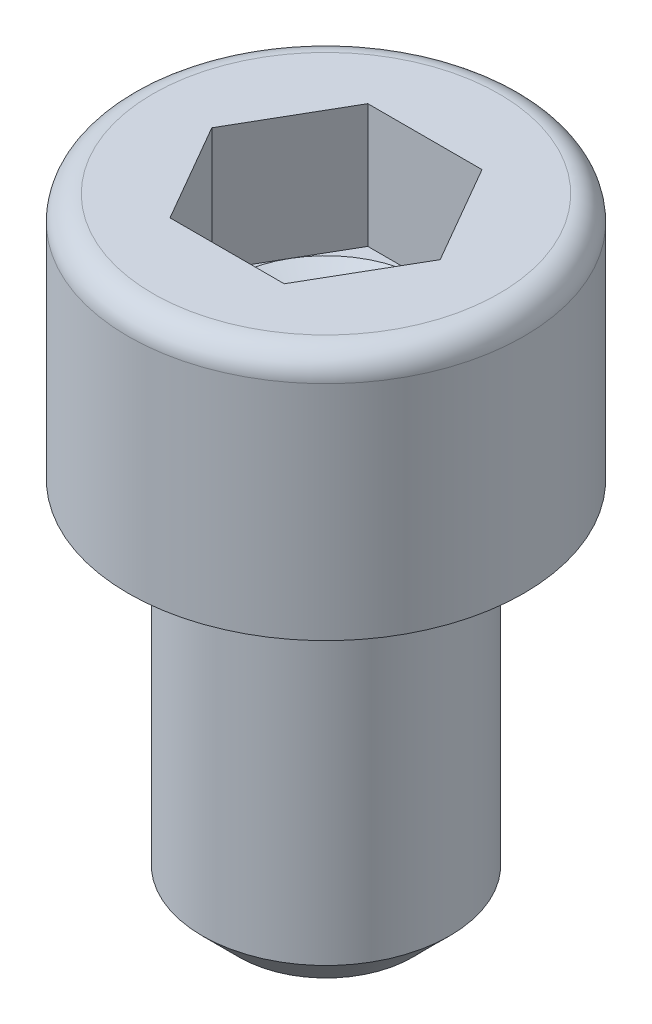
ISO-10303-21;
HEADER;
FILE_DESCRIPTION(('STEP AP214'),'2;1');
FILE_NAME('part.step','',(''),(''),'','','');
FILE_SCHEMA(('AUTOMOTIVE_DESIGN { 1 0 10303 214 1 1 1 1 }'));
ENDSEC;
DATA;
#1=APPLICATION_CONTEXT('core data for automotive mechanical design processes');
#2=APPLICATION_PROTOCOL_DEFINITION('international standard','automotive_design',2000,#1);
#3=PRODUCT_CONTEXT('',#1,'mechanical');
#4=PRODUCT('Part','Part','',(#3));
#5=PRODUCT_RELATED_PRODUCT_CATEGORY('part','',(#4));
#6=PRODUCT_DEFINITION_FORMATION('','',#4);
#7=PRODUCT_DEFINITION_CONTEXT('part definition',#1,'design');
#8=PRODUCT_DEFINITION('design','',#6,#7);
#9=PRODUCT_DEFINITION_SHAPE('','',#8);
#10=(LENGTH_UNIT() NAMED_UNIT(*) SI_UNIT(.MILLI.,.METRE.));
#11=(NAMED_UNIT(*) PLANE_ANGLE_UNIT() SI_UNIT($,.RADIAN.));
#12=(NAMED_UNIT(*) SI_UNIT($,.STERADIAN.) SOLID_ANGLE_UNIT());
#13=UNCERTAINTY_MEASURE_WITH_UNIT(LENGTH_MEASURE(1.E-05),#10,'distance_accuracy_value','');
#14=(GEOMETRIC_REPRESENTATION_CONTEXT(3) GLOBAL_UNCERTAINTY_ASSIGNED_CONTEXT((#13)) GLOBAL_UNIT_ASSIGNED_CONTEXT((#10,
#11,#12)) REPRESENTATION_CONTEXT('',''));
#15=CARTESIAN_POINT('',(0.,0.,0.));
#16=DIRECTION('',(0.,0.,1.));
#17=DIRECTION('',(1.,0.,0.));
#18=AXIS2_PLACEMENT_3D('',#15,#16,#17);
#19=CARTESIAN_POINT('',(4.,10.,0.));
#20=DIRECTION('',(0.,-1.,0.));
#21=DIRECTION('',(1.,0.,0.));
#22=AXIS2_PLACEMENT_3D('',#19,#20,#21);
#23=PLANE('',#22);
#24=CARTESIAN_POINT('',(0.,10.,0.));
#25=DIRECTION('',(0.,1.,0.));
#26=DIRECTION('',(-1.,0.,0.));
#27=AXIS2_PLACEMENT_3D('',#24,#25,#26);
#28=CIRCLE('',#27,7.);
#29=CARTESIAN_POINT('',(-7.,10.,0.));
#30=VERTEX_POINT('',#29);
#31=EDGE_CURVE('E138',#30,#30,#28,.T.);
#32=ORIENTED_EDGE('',*,*,#31,.T.);
#33=EDGE_LOOP('',(#32));
#34=FACE_BOUND('',#33,.T.);
#35=DIRECTION('',(0.499999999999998,0.,0.86602540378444));
#36=VECTOR('',#35,1.);
#37=CARTESIAN_POINT('',(2.30940107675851,10.,-4.));
#38=LINE('',#37,#36);
#39=CARTESIAN_POINT('',(2.30940107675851,10.,-4.));
#40=VERTEX_POINT('',#39);
#41=CARTESIAN_POINT('',(4.618802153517,10.,0.));
#42=VERTEX_POINT('',#41);
#43=EDGE_CURVE('E370',#40,#42,#38,.T.);
#44=ORIENTED_EDGE('',*,*,#43,.T.);
#45=DIRECTION('',(-0.499999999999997,0.,0.86602540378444));
#46=VECTOR('',#45,1.);
#47=CARTESIAN_POINT('',(2.30940107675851,10.,4.));
#48=LINE('',#47,#46);
#49=CARTESIAN_POINT('',(2.30940107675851,10.,4.));
#50=VERTEX_POINT('',#49);
#51=EDGE_CURVE('E373',#42,#50,#48,.T.);
#52=ORIENTED_EDGE('',*,*,#51,.T.);
#53=DIRECTION('',(-1.,0.,0.));
#54=VECTOR('',#53,1.);
#55=CARTESIAN_POINT('',(2.30940107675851,10.,4.));
#56=LINE('',#55,#54);
#57=CARTESIAN_POINT('',(-2.30940107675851,10.,4.));
#58=VERTEX_POINT('',#57);
#59=EDGE_CURVE('E376',#50,#58,#56,.T.);
#60=ORIENTED_EDGE('',*,*,#59,.T.);
#61=DIRECTION('',(-0.499999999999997,0.,-0.86602540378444));
#62=VECTOR('',#61,1.);
#63=CARTESIAN_POINT('',(-2.30940107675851,10.,4.));
#64=LINE('',#63,#62);
#65=CARTESIAN_POINT('',(-4.618802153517,10.,0.));
#66=VERTEX_POINT('',#65);
#67=EDGE_CURVE('E115',#58,#66,#64,.T.);
#68=ORIENTED_EDGE('',*,*,#67,.T.);
#69=DIRECTION('',(0.499999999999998,0.,-0.86602540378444));
#70=VECTOR('',#69,1.);
#71=CARTESIAN_POINT('',(-2.30940107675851,10.,-4.));
#72=LINE('',#71,#70);
#73=CARTESIAN_POINT('',(-2.30940107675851,10.,-4.));
#74=VERTEX_POINT('',#73);
#75=EDGE_CURVE('E367',#66,#74,#72,.T.);
#76=ORIENTED_EDGE('',*,*,#75,.T.);
#77=DIRECTION('',(1.,0.,0.));
#78=VECTOR('',#77,1.);
#79=CARTESIAN_POINT('',(2.30940107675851,10.,-4.));
#80=LINE('',#79,#78);
#81=EDGE_CURVE('E126',#74,#40,#80,.T.);
#82=ORIENTED_EDGE('',*,*,#81,.T.);
#83=EDGE_LOOP('',(#44,#52,#60,#68,#76,#82));
#84=FACE_BOUND('',#83,.T.);
#85=ADVANCED_FACE('F32',(#34,#84),#23,.F.);
#86=CARTESIAN_POINT('',(0.,-15.,0.));
#87=DIRECTION('',(0.,1.,0.));
#88=DIRECTION('',(0.,0.,1.));
#89=AXIS2_PLACEMENT_3D('',#86,#87,#88);
#90=CYLINDRICAL_SURFACE('',#89,5.);
#91=CARTESIAN_POINT('',(0.,-13.5,0.));
#92=DIRECTION('',(0.,1.,0.));
#93=DIRECTION('',(0.,0.,1.));
#94=AXIS2_PLACEMENT_3D('',#91,#92,#93);
#95=CIRCLE('',#94,5.);
#96=CARTESIAN_POINT('',(0.,-13.5,5.));
#97=VERTEX_POINT('',#96);
#98=EDGE_CURVE('E40',#97,#97,#95,.T.);
#99=ORIENTED_EDGE('',*,*,#98,.T.);
#100=EDGE_LOOP('',(#99));
#101=FACE_BOUND('',#100,.T.);
#102=CARTESIAN_POINT('',(0.,0.,0.));
#103=DIRECTION('',(0.,1.,0.));
#104=DIRECTION('',(0.,0.,1.));
#105=AXIS2_PLACEMENT_3D('',#102,#103,#104);
#106=CIRCLE('',#105,5.);
#107=CARTESIAN_POINT('',(0.,0.,5.));
#108=VERTEX_POINT('',#107);
#109=EDGE_CURVE('E148',#108,#108,#106,.T.);
#110=ORIENTED_EDGE('',*,*,#109,.F.);
#111=EDGE_LOOP('',(#110));
#112=FACE_BOUND('',#111,.T.);
#113=ADVANCED_FACE('F153',(#101,#112),#90,.T.);
#114=CARTESIAN_POINT('',(0.,-15.,0.));
#115=DIRECTION('',(0.,1.,0.));
#116=DIRECTION('',(0.,0.,1.));
#117=AXIS2_PLACEMENT_3D('',#114,#115,#116);
#118=PLANE('',#117);
#119=CARTESIAN_POINT('',(0.,-15.,0.));
#120=DIRECTION('',(0.,1.,0.));
#121=DIRECTION('',(0.,0.,1.));
#122=AXIS2_PLACEMENT_3D('',#119,#120,#121);
#123=CIRCLE('',#122,3.5);
#124=CARTESIAN_POINT('',(0.,-15.,3.5));
#125=VERTEX_POINT('',#124);
#126=EDGE_CURVE('E11',#125,#125,#123,.F.);
#127=ORIENTED_EDGE('',*,*,#126,.T.);
#128=EDGE_LOOP('',(#127));
#129=FACE_BOUND('',#128,.T.);
#130=ADVANCED_FACE('F158',(#129),#118,.F.);
#131=CARTESIAN_POINT('',(0.,-13.5,0.));
#132=DIRECTION('',(0.,1.,0.));
#133=DIRECTION('',(0.,0.,1.));
#134=AXIS2_PLACEMENT_3D('',#131,#132,#133);
#135=CONICAL_SURFACE('',#134,5.,0.785398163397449);
#136=ORIENTED_EDGE('',*,*,#126,.F.);
#137=EDGE_LOOP('',(#136));
#138=FACE_BOUND('',#137,.T.);
#139=ORIENTED_EDGE('',*,*,#98,.F.);
#140=EDGE_LOOP('',(#139));
#141=FACE_BOUND('',#140,.T.);
#142=ADVANCED_FACE('F34',(#138,#141),#135,.T.);
#143=CARTESIAN_POINT('',(0.,0.,0.));
#144=DIRECTION('',(0.,1.,0.));
#145=DIRECTION('',(-1.,0.,0.));
#146=AXIS2_PLACEMENT_3D('',#143,#144,#145);
#147=PLANE('',#146);
#148=ORIENTED_EDGE('',*,*,#109,.T.);
#149=EDGE_LOOP('',(#148));
#150=FACE_BOUND('',#149,.T.);
#151=CARTESIAN_POINT('',(0.,0.,0.));
#152=DIRECTION('',(0.,1.,0.));
#153=DIRECTION('',(-1.,0.,0.));
#154=AXIS2_PLACEMENT_3D('',#151,#152,#153);
#155=CIRCLE('',#154,8.);
#156=CARTESIAN_POINT('',(-8.,0.,0.));
#157=VERTEX_POINT('',#156);
#158=EDGE_CURVE('E145',#157,#157,#155,.T.);
#159=ORIENTED_EDGE('',*,*,#158,.F.);
#160=EDGE_LOOP('',(#159));
#161=FACE_BOUND('',#160,.T.);
#162=ADVANCED_FACE('F157',(#150,#161),#147,.F.);
#163=CARTESIAN_POINT('',(0.,10.,0.));
#164=DIRECTION('',(0.,1.,0.));
#165=DIRECTION('',(-1.,0.,0.));
#166=AXIS2_PLACEMENT_3D('',#163,#164,#165);
#167=CYLINDRICAL_SURFACE('',#166,8.);
#168=CARTESIAN_POINT('',(0.,9.,0.));
#169=DIRECTION('',(0.,1.,0.));
#170=DIRECTION('',(-1.,0.,0.));
#171=AXIS2_PLACEMENT_3D('',#168,#169,#170);
#172=CIRCLE('',#171,8.);
#173=CARTESIAN_POINT('',(-8.,9.,0.));
#174=VERTEX_POINT('',#173);
#175=EDGE_CURVE('E142',#174,#174,#172,.T.);
#176=ORIENTED_EDGE('',*,*,#175,.F.);
#177=EDGE_LOOP('',(#176));
#178=FACE_BOUND('',#177,.T.);
#179=ORIENTED_EDGE('',*,*,#158,.T.);
#180=EDGE_LOOP('',(#179));
#181=FACE_BOUND('',#180,.T.);
#182=ADVANCED_FACE('F164',(#178,#181),#167,.T.);
#183=CARTESIAN_POINT('',(0.,9.,0.));
#184=DIRECTION('',(0.,1.,0.));
#185=DIRECTION('',(-1.,0.,0.));
#186=AXIS2_PLACEMENT_3D('',#183,#184,#185);
#187=TOROIDAL_SURFACE('',#186,7.,0.999999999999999);
#188=ORIENTED_EDGE('',*,*,#31,.F.);
#189=EDGE_LOOP('',(#188));
#190=FACE_BOUND('',#189,.T.);
#191=ORIENTED_EDGE('',*,*,#175,.T.);
#192=EDGE_LOOP('',(#191));
#193=FACE_BOUND('',#192,.T.);
#194=ADVANCED_FACE('F181',(#190,#193),#187,.T.);
#195=CARTESIAN_POINT('',(-2.30940107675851,5.,-4.));
#196=DIRECTION('',(0.86602540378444,0.,0.499999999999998));
#197=DIRECTION('',(0.499999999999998,0.,-0.86602540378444));
#198=AXIS2_PLACEMENT_3D('',#195,#196,#197);
#199=PLANE('',#198);
#200=ORIENTED_EDGE('',*,*,#75,.F.);
#201=DIRECTION('',(0.,1.,0.));
#202=VECTOR('',#201,1.);
#203=CARTESIAN_POINT('',(-4.618802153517,5.,0.));
#204=LINE('',#203,#202);
#205=CARTESIAN_POINT('',(-4.618802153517,5.,0.));
#206=VERTEX_POINT('',#205);
#207=EDGE_CURVE('E362',#206,#66,#204,.T.);
#208=ORIENTED_EDGE('',*,*,#207,.F.);
#209=DIRECTION('',(0.499999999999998,0.,-0.86602540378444));
#210=VECTOR('',#209,1.);
#211=CARTESIAN_POINT('',(-2.30940107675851,5.,-4.));
#212=LINE('',#211,#210);
#213=CARTESIAN_POINT('',(-3.46410161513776,5.,-1.99999999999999));
#214=VERTEX_POINT('',#213);
#215=EDGE_CURVE('E111',#206,#214,#212,.T.);
#216=ORIENTED_EDGE('',*,*,#215,.T.);
#217=CARTESIAN_POINT('',(-2.30940107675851,5.,-4.));
#218=VERTEX_POINT('',#217);
#219=EDGE_CURVE('E105',#214,#218,#212,.T.);
#220=ORIENTED_EDGE('',*,*,#219,.T.);
#221=DIRECTION('',(0.,1.,0.));
#222=VECTOR('',#221,1.);
#223=CARTESIAN_POINT('',(-2.30940107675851,5.,-4.));
#224=LINE('',#223,#222);
#225=EDGE_CURVE('E107',#218,#74,#224,.T.);
#226=ORIENTED_EDGE('',*,*,#225,.T.);
#227=EDGE_LOOP('',(#200,#208,#216,#220,#226));
#228=FACE_BOUND('',#227,.T.);
#229=ADVANCED_FACE('F106',(#228),#199,.T.);
#230=CARTESIAN_POINT('',(2.30940107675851,5.,-4.));
#231=DIRECTION('',(0.,0.,1.));
#232=DIRECTION('',(1.,0.,0.));
#233=AXIS2_PLACEMENT_3D('',#230,#231,#232);
#234=PLANE('',#233);
#235=ORIENTED_EDGE('',*,*,#81,.F.);
#236=ORIENTED_EDGE('',*,*,#225,.F.);
#237=DIRECTION('',(1.,0.,0.));
#238=VECTOR('',#237,1.);
#239=CARTESIAN_POINT('',(2.30940107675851,5.,-4.));
#240=LINE('',#239,#238);
#241=CARTESIAN_POINT('',(0.,5.,-4.));
#242=VERTEX_POINT('',#241);
#243=EDGE_CURVE('E47',#218,#242,#240,.T.);
#244=ORIENTED_EDGE('',*,*,#243,.T.);
#245=CARTESIAN_POINT('',(2.30940107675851,5.,-4.));
#246=VERTEX_POINT('',#245);
#247=EDGE_CURVE('E121',#242,#246,#240,.T.);
#248=ORIENTED_EDGE('',*,*,#247,.T.);
#249=DIRECTION('',(0.,1.,0.));
#250=VECTOR('',#249,1.);
#251=CARTESIAN_POINT('',(2.30940107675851,5.,-4.));
#252=LINE('',#251,#250);
#253=EDGE_CURVE('E128',#246,#40,#252,.T.);
#254=ORIENTED_EDGE('',*,*,#253,.T.);
#255=EDGE_LOOP('',(#235,#236,#244,#248,#254));
#256=FACE_BOUND('',#255,.T.);
#257=ADVANCED_FACE('F123',(#256),#234,.T.);
#258=CARTESIAN_POINT('',(2.30940107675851,5.,-4.));
#259=DIRECTION('',(-0.86602540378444,0.,0.499999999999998));
#260=DIRECTION('',(0.499999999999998,0.,0.86602540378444));
#261=AXIS2_PLACEMENT_3D('',#258,#259,#260);
#262=PLANE('',#261);
#263=ORIENTED_EDGE('',*,*,#43,.F.);
#264=ORIENTED_EDGE('',*,*,#253,.F.);
#265=DIRECTION('',(0.499999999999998,0.,0.86602540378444));
#266=VECTOR('',#265,1.);
#267=CARTESIAN_POINT('',(2.30940107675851,5.,-4.));
#268=LINE('',#267,#266);
#269=CARTESIAN_POINT('',(3.46410161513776,5.,-1.99999999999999));
#270=VERTEX_POINT('',#269);
#271=EDGE_CURVE('E395',#246,#270,#268,.T.);
#272=ORIENTED_EDGE('',*,*,#271,.T.);
#273=CARTESIAN_POINT('',(4.618802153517,5.,0.));
#274=VERTEX_POINT('',#273);
#275=EDGE_CURVE('E120',#270,#274,#268,.T.);
#276=ORIENTED_EDGE('',*,*,#275,.T.);
#277=DIRECTION('',(0.,1.,0.));
#278=VECTOR('',#277,1.);
#279=CARTESIAN_POINT('',(4.618802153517,5.,0.));
#280=LINE('',#279,#278);
#281=EDGE_CURVE('E133',#274,#42,#280,.T.);
#282=ORIENTED_EDGE('',*,*,#281,.T.);
#283=EDGE_LOOP('',(#263,#264,#272,#276,#282));
#284=FACE_BOUND('',#283,.T.);
#285=ADVANCED_FACE('F211',(#284),#262,.T.);
#286=CARTESIAN_POINT('',(2.30940107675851,5.,4.));
#287=DIRECTION('',(-0.86602540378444,0.,-0.499999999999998));
#288=DIRECTION('',(-0.499999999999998,0.,0.86602540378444));
#289=AXIS2_PLACEMENT_3D('',#286,#287,#288);
#290=PLANE('',#289);
#291=ORIENTED_EDGE('',*,*,#51,.F.);
#292=ORIENTED_EDGE('',*,*,#281,.F.);
#293=DIRECTION('',(-0.499999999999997,0.,0.86602540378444));
#294=VECTOR('',#293,1.);
#295=CARTESIAN_POINT('',(2.30940107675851,5.,4.));
#296=LINE('',#295,#294);
#297=CARTESIAN_POINT('',(3.46410161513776,5.,1.99999999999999));
#298=VERTEX_POINT('',#297);
#299=EDGE_CURVE('E393',#274,#298,#296,.T.);
#300=ORIENTED_EDGE('',*,*,#299,.T.);
#301=CARTESIAN_POINT('',(2.30940107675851,5.,4.));
#302=VERTEX_POINT('',#301);
#303=EDGE_CURVE('E394',#298,#302,#296,.T.);
#304=ORIENTED_EDGE('',*,*,#303,.T.);
#305=DIRECTION('',(0.,1.,0.));
#306=VECTOR('',#305,1.);
#307=CARTESIAN_POINT('',(2.30940107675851,5.,4.));
#308=LINE('',#307,#306);
#309=EDGE_CURVE('E382',#302,#50,#308,.T.);
#310=ORIENTED_EDGE('',*,*,#309,.T.);
#311=EDGE_LOOP('',(#291,#292,#300,#304,#310));
#312=FACE_BOUND('',#311,.T.);
#313=ADVANCED_FACE('F218',(#312),#290,.T.);
#314=CARTESIAN_POINT('',(2.30940107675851,5.,4.));
#315=DIRECTION('',(0.,0.,-1.));
#316=DIRECTION('',(-1.,0.,0.));
#317=AXIS2_PLACEMENT_3D('',#314,#315,#316);
#318=PLANE('',#317);
#319=ORIENTED_EDGE('',*,*,#59,.F.);
#320=ORIENTED_EDGE('',*,*,#309,.F.);
#321=DIRECTION('',(-1.,0.,0.));
#322=VECTOR('',#321,1.);
#323=CARTESIAN_POINT('',(2.30940107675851,5.,4.));
#324=LINE('',#323,#322);
#325=CARTESIAN_POINT('',(0.,5.,4.));
#326=VERTEX_POINT('',#325);
#327=EDGE_CURVE('E357',#302,#326,#324,.T.);
#328=ORIENTED_EDGE('',*,*,#327,.T.);
#329=CARTESIAN_POINT('',(-2.30940107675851,5.,4.));
#330=VERTEX_POINT('',#329);
#331=EDGE_CURVE('E353',#326,#330,#324,.T.);
#332=ORIENTED_EDGE('',*,*,#331,.T.);
#333=DIRECTION('',(0.,1.,0.));
#334=VECTOR('',#333,1.);
#335=CARTESIAN_POINT('',(-2.30940107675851,5.,4.));
#336=LINE('',#335,#334);
#337=EDGE_CURVE('E361',#330,#58,#336,.T.);
#338=ORIENTED_EDGE('',*,*,#337,.T.);
#339=EDGE_LOOP('',(#319,#320,#328,#332,#338));
#340=FACE_BOUND('',#339,.T.);
#341=ADVANCED_FACE('F226',(#340),#318,.T.);
#342=CARTESIAN_POINT('',(-2.30940107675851,5.,4.));
#343=DIRECTION('',(0.86602540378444,0.,-0.499999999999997));
#344=DIRECTION('',(-0.499999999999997,0.,-0.86602540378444));
#345=AXIS2_PLACEMENT_3D('',#342,#343,#344);
#346=PLANE('',#345);
#347=ORIENTED_EDGE('',*,*,#67,.F.);
#348=ORIENTED_EDGE('',*,*,#337,.F.);
#349=DIRECTION('',(-0.499999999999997,0.,-0.86602540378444));
#350=VECTOR('',#349,1.);
#351=CARTESIAN_POINT('',(-2.30940107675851,5.,4.));
#352=LINE('',#351,#350);
#353=CARTESIAN_POINT('',(-3.46410161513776,5.,1.99999999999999));
#354=VERTEX_POINT('',#353);
#355=EDGE_CURVE('E352',#330,#354,#352,.T.);
#356=ORIENTED_EDGE('',*,*,#355,.T.);
#357=EDGE_CURVE('E355',#354,#206,#352,.T.);
#358=ORIENTED_EDGE('',*,*,#357,.T.);
#359=ORIENTED_EDGE('',*,*,#207,.T.);
#360=EDGE_LOOP('',(#347,#348,#356,#358,#359));
#361=FACE_BOUND('',#360,.T.);
#362=ADVANCED_FACE('F234',(#361),#346,.T.);
#363=CARTESIAN_POINT('',(-6.92820323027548,5.,4.));
#364=DIRECTION('',(0.,-1.,0.));
#365=DIRECTION('',(0.,0.,-1.));
#366=AXIS2_PLACEMENT_3D('',#363,#364,#365);
#367=PLANE('',#366);
#368=ORIENTED_EDGE('',*,*,#243,.F.);
#369=ORIENTED_EDGE('',*,*,#219,.F.);
#370=CARTESIAN_POINT('',(0.,5.,0.));
#371=DIRECTION('',(0.,1.,0.));
#372=DIRECTION('',(-1.,0.,0.));
#373=AXIS2_PLACEMENT_3D('',#370,#371,#372);
#374=CIRCLE('',#373,4.);
#375=EDGE_CURVE('E118',#242,#214,#374,.T.);
#376=ORIENTED_EDGE('',*,*,#375,.F.);
#377=EDGE_LOOP('',(#368,#369,#376));
#378=FACE_BOUND('',#377,.T.);
#379=ADVANCED_FACE('F117',(#378),#367,.F.);
#380=ORIENTED_EDGE('',*,*,#215,.F.);
#381=ORIENTED_EDGE('',*,*,#357,.F.);
#382=EDGE_CURVE('E127',#214,#354,#374,.T.);
#383=ORIENTED_EDGE('',*,*,#382,.F.);
#384=EDGE_LOOP('',(#380,#381,#383));
#385=FACE_BOUND('',#384,.T.);
#386=ADVANCED_FACE('F249',(#385),#367,.F.);
#387=ORIENTED_EDGE('',*,*,#355,.F.);
#388=ORIENTED_EDGE('',*,*,#331,.F.);
#389=EDGE_CURVE('E132',#354,#326,#374,.T.);
#390=ORIENTED_EDGE('',*,*,#389,.F.);
#391=EDGE_LOOP('',(#387,#388,#390));
#392=FACE_BOUND('',#391,.T.);
#393=ADVANCED_FACE('F257',(#392),#367,.F.);
#394=ORIENTED_EDGE('',*,*,#327,.F.);
#395=ORIENTED_EDGE('',*,*,#303,.F.);
#396=EDGE_CURVE('E139',#326,#298,#374,.T.);
#397=ORIENTED_EDGE('',*,*,#396,.F.);
#398=EDGE_LOOP('',(#394,#395,#397));
#399=FACE_BOUND('',#398,.T.);
#400=ADVANCED_FACE('F264',(#399),#367,.F.);
#401=ORIENTED_EDGE('',*,*,#299,.F.);
#402=ORIENTED_EDGE('',*,*,#275,.F.);
#403=EDGE_CURVE('E399',#298,#270,#374,.T.);
#404=ORIENTED_EDGE('',*,*,#403,.F.);
#405=EDGE_LOOP('',(#401,#402,#404));
#406=FACE_BOUND('',#405,.T.);
#407=ADVANCED_FACE('F271',(#406),#367,.F.);
#408=ORIENTED_EDGE('',*,*,#271,.F.);
#409=ORIENTED_EDGE('',*,*,#247,.F.);
#410=EDGE_CURVE('E398',#270,#242,#374,.T.);
#411=ORIENTED_EDGE('',*,*,#410,.F.);
#412=EDGE_LOOP('',(#408,#409,#411));
#413=FACE_BOUND('',#412,.T.);
#414=ADVANCED_FACE('F251',(#413),#367,.F.);
#415=CARTESIAN_POINT('',(0.,5.,0.));
#416=DIRECTION('',(0.,1.,0.));
#417=DIRECTION('',(-1.,0.,0.));
#418=AXIS2_PLACEMENT_3D('',#415,#416,#417);
#419=CONICAL_SURFACE('',#418,4.,1.04719755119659);
#420=CARTESIAN_POINT('',(0.,2.69059892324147,0.));
#421=VERTEX_POINT('',#420);
#422=VERTEX_LOOP('',#421);
#423=FACE_BOUND('',#422,.T.);
#424=ORIENTED_EDGE('',*,*,#389,.T.);
#425=ORIENTED_EDGE('',*,*,#396,.T.);
#426=ORIENTED_EDGE('',*,*,#403,.T.);
#427=ORIENTED_EDGE('',*,*,#410,.T.);
#428=ORIENTED_EDGE('',*,*,#375,.T.);
#429=ORIENTED_EDGE('',*,*,#382,.T.);
#430=EDGE_LOOP('',(#424,#425,#426,#427,#428,#429));
#431=FACE_BOUND('',#430,.T.);
#432=ADVANCED_FACE('F179',(#423,#431),#419,.F.);
#433=CLOSED_SHELL('',(#85,#113,#130,#142,#162,#182,#194,#229,#257,#285,#313,#341,#362,#379,#386,
#393,#400,#407,#414,#432));
#434=MANIFOLD_SOLID_BREP('B2',#433);
#435=ADVANCED_BREP_SHAPE_REPRESENTATION('',(#18,#434),#14);
#436=SHAPE_DEFINITION_REPRESENTATION(#9,#435);
ENDSEC;
END-ISO-10303-21;
